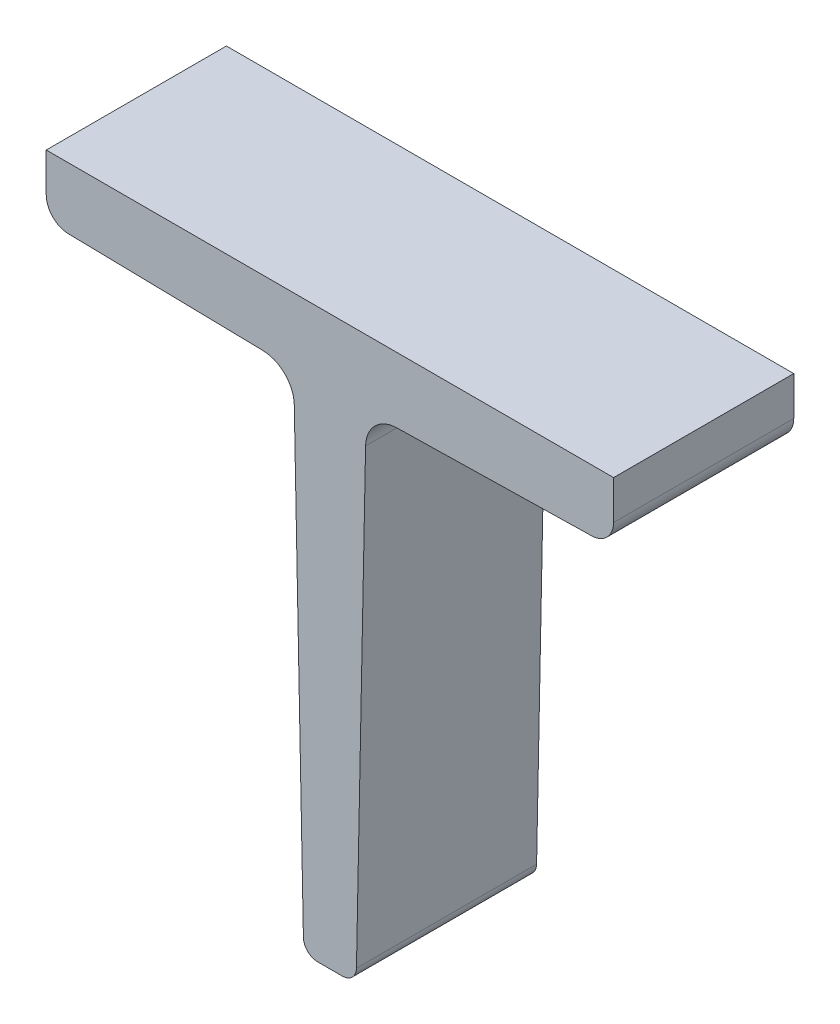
from build123d import *

# Parameters (mm, degrees)
BASESTEE_DEPTH = 12.7
INSIDEFILLET_R = 4.5
TOEFILLET_R    = 3.175
ENDFILLET_R    = 2


with BuildPart() as part:
    # Sketch1 → BaseStee (new, symmetric)
    with BuildSketch(Plane.XY):
        Polygon((0, 0), (80, 0), (80, -8.599917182), (45.114171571, -9.297778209), (43.699834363, -80), (36.300165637, -80), (34.885828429, -9.297778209), (0, -8.599917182), align=None)
    extrude(amount=BASESTEE_DEPTH, both=True)

    # InsideFillet
    insidefillet_edges = [part.edges().sort_by_distance(p)[0] for p in [
        (45.114171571, -9.297778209, 0),
        (34.885828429, -9.297778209, 0),
    ]]
    fillet(insidefillet_edges, radius=INSIDEFILLET_R)

    # ToeFillet
    toefillet_edges = [part.edges().sort_by_distance(p)[0] for p in [
        (80, -8.599917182, 0),
        (0, -8.599917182, 0),
    ]]
    fillet(toefillet_edges, radius=TOEFILLET_R)

    # EndFillet
    endfillet_edges = [part.edges().sort_by_distance(p)[0] for p in [
        (43.699834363, -80, 0),
        (36.300165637, -80, 0),
    ]]
    fillet(endfillet_edges, radius=ENDFILLET_R)


solid = part.part
